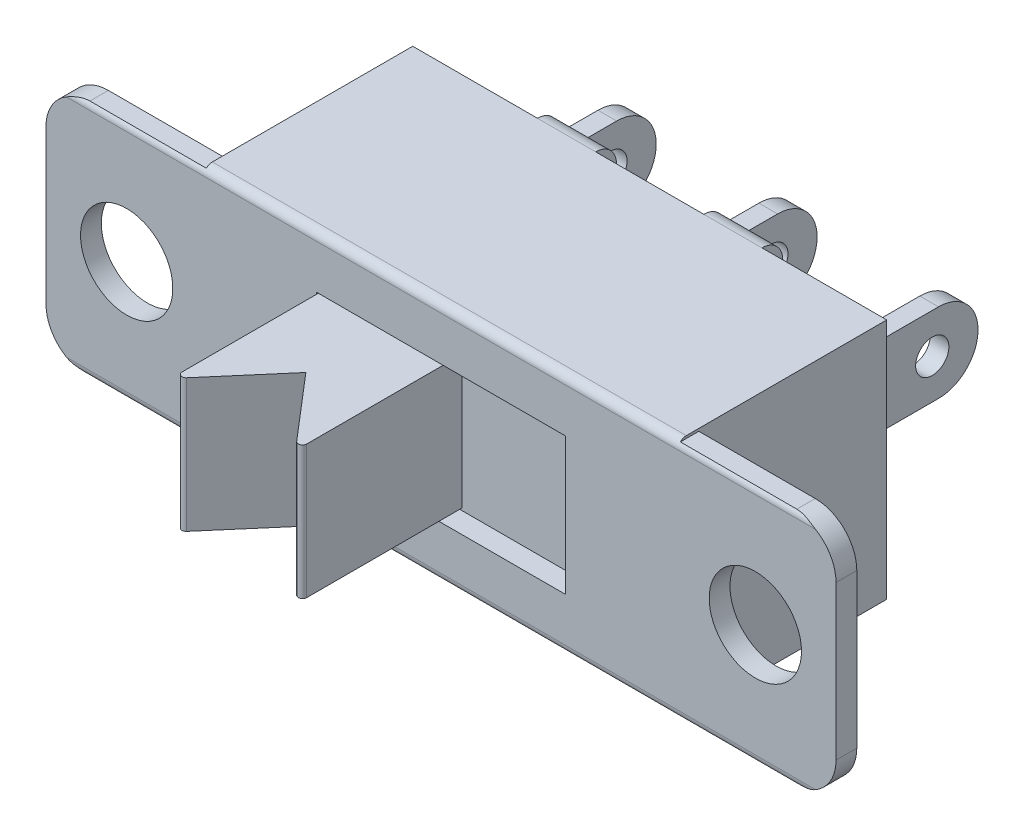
from build123d import *

# Parameters (mm, degrees)
ESQUISSE1_R             = 1.11
BASE_EXTRUSION_DEPTH    = 0.5
ESQUISSE2_W             = 11.4
ESQUISSE2_H             = 5.82
BOSS_EXTRU_1_DEPTH      = 5.02
ESQUISSE3_W             = 6
ESQUISSE3_H             = 3.3
ENL_V_MAT_EXTRU_1_DEPTH = 0.5
ESQUISSE4_W             = 3
ESQUISSE4_H             = 3.2
BOSS_EXTRU_2_DEPTH      = 4
ENL_V_MAT_EXTRU_2_DEPTH = 12.446418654
CONG_1_R                = 0.1
ESQUISSE6_W             = 0.45
ESQUISSE6_H             = 1.91
BOSS_EXTRU_3_DEPTH      = 3.8
CONG_2_R                = 0.95
ESQUISSE7_R             = 0.4
ENL_V_MAT_EXTRU_3_DEPTH = 17.202299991
ESQUISSE8_W             = 1.4
ESQUISSE8_H             = 1.4
BOSS_EXTRU_4_DEPTH      = 0.5
CONG_3_R                = 0.5
CONG_4_R                = 0.2


with BuildPart() as part:
    # Esquisse1 → Base-Extrusion (new body)
    with BuildSketch(Plane.XY):
        with BuildLine():
            Line((-8.5, 2.85), (8.5, 2.85))
            ThreePointArc((8.5, 2.85), (9.207106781, 2.557106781), (9.5, 1.85))
            Line((9.5, 1.85), (9.5, -1.85))
            ThreePointArc((9.5, -1.85), (9.207106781, -2.557106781), (8.5, -2.85))
            Line((8.5, -2.85), (-8.5, -2.85))
            ThreePointArc((-8.5, -2.85), (-9.207106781, -2.557106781), (-9.5, -1.85))
            Line((-9.5, -1.85), (-9.5, 1.85))
            ThreePointArc((-9.5, 1.85), (-9.207106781, 2.557106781), (-8.5, 2.85))
        make_face()
        with Locations((7.56, 0)):
            Circle(ESQUISSE1_R, mode=Mode.SUBTRACT)
        with Locations(Location((-7.56, 0, 0), (0, 0, 180))):
            Circle(ESQUISSE1_R, mode=Mode.SUBTRACT)
    extrude(amount=BASE_EXTRUSION_DEPTH)

    # Esquisse2 → Boss.-Extru.1 (add)
    with BuildSketch(Plane.XY.offset(0.5)):
        Rectangle(ESQUISSE2_W, ESQUISSE2_H)
    extrude(amount=-BOSS_EXTRU_1_DEPTH)

    # Esquisse3 → Enl_v. mat.-Extru.1 (cut)
    with BuildSketch(Plane.XY.offset(0.5)):
        Rectangle(ESQUISSE3_W, ESQUISSE3_H)
    extrude(amount=-ENL_V_MAT_EXTRU_1_DEPTH, mode=Mode.SUBTRACT)

    # Esquisse4 → Boss.-Extru.2 (add)
    with BuildSketch(Plane.XY):
        with Locations((-1.5, 0)):
            Rectangle(ESQUISSE4_W, ESQUISSE4_H)
    extrude(amount=BOSS_EXTRU_2_DEPTH)

    # Esquisse5 → Enl_v. mat.-Extru.2 (cut, through all)
    with BuildSketch(Plane.XZ.offset(1.6)):
        Polygon((0, 4), (-1.5, 2.25), (-3, 4), (-3, 5.046492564), (0, 5.046492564), align=None)
    extrude(amount=-ENL_V_MAT_EXTRU_2_DEPTH, mode=Mode.SUBTRACT)

    # Cong_1
    cong_1_edges = [part.edges().sort_by_distance(p)[0] for p in [
        (-3, 0, 4),
        (0, 0, 4),
    ]]
    fillet(cong_1_edges, radius=CONG_1_R)

    # Esquisse6 → Boss.-Extru.3 (add)
    with BuildSketch(Plane(origin=(0, 0, -4.52), x_dir=(-1, 0, 0), z_dir=(0, 0, -1))):
        Rectangle(ESQUISSE6_W, ESQUISSE6_H)
        with Locations((3.87, 0)):
            Rectangle(ESQUISSE6_W, ESQUISSE6_H)
        with Locations((-3.87, 0)):
            Rectangle(ESQUISSE6_W, ESQUISSE6_H)
    extrude(amount=BOSS_EXTRU_3_DEPTH)

    # Cong_2
    cong_2_edges = [part.edges().sort_by_distance(p)[0] for p in [
        (3.87, 0.955, -8.32),
        (3.87, -0.955, -8.32),
        (0, -0.955, -8.32),
        (0, 0.955, -8.32),
        (-3.87, -0.955, -8.32),
        (-3.87, 0.955, -8.32),
    ]]
    fillet(cong_2_edges, radius=CONG_2_R)

    # Esquisse7 → Enl_v. mat.-Extru.3 (cut, through all)
    with BuildSketch(Plane(origin=(4.095, 0, 0), x_dir=(0, 0, -1), z_dir=(1, 0, 0))):
        with Locations((7.22, 0)):
            Circle(ESQUISSE7_R)
    extrude(amount=-ENL_V_MAT_EXTRU_3_DEPTH, mode=Mode.SUBTRACT)

    # Esquisse8 → Boss.-Extru.4 (add)
    with BuildSketch(Plane(origin=(0, 0, -4.52), x_dir=(-1, 0, 0), z_dir=(0, 0, -1))):
        with Locations((2, -2.21)):
            Rectangle(ESQUISSE8_W, ESQUISSE8_H)
        with Locations((2, 2.21)):
            Rectangle(ESQUISSE8_W, ESQUISSE8_H)
        with Locations((-2, 2.21)):
            Rectangle(ESQUISSE8_W, ESQUISSE8_H)
        with Locations((-2, -2.21)):
            Rectangle(ESQUISSE8_W, ESQUISSE8_H)
    extrude(amount=BOSS_EXTRU_4_DEPTH)

    # Cong_3
    cong_3_edges = [part.edges().sort_by_distance(p)[0] for p in [
        (2, -2.91, -5.02),
        (-2, -2.91, -5.02),
        (-2, 2.91, -5.02),
        (2, 2.91, -5.02),
    ]]
    fillet(cong_3_edges, radius=CONG_3_R)

    # Cong_4
    cong_4_edges = [part.edges().sort_by_distance(p)[0] for p in [
        (0, -2.91, 0.5),
        (0, 2.91, 0.5),
    ]]
    fillet(cong_4_edges, radius=CONG_4_R)


solid = part.part
